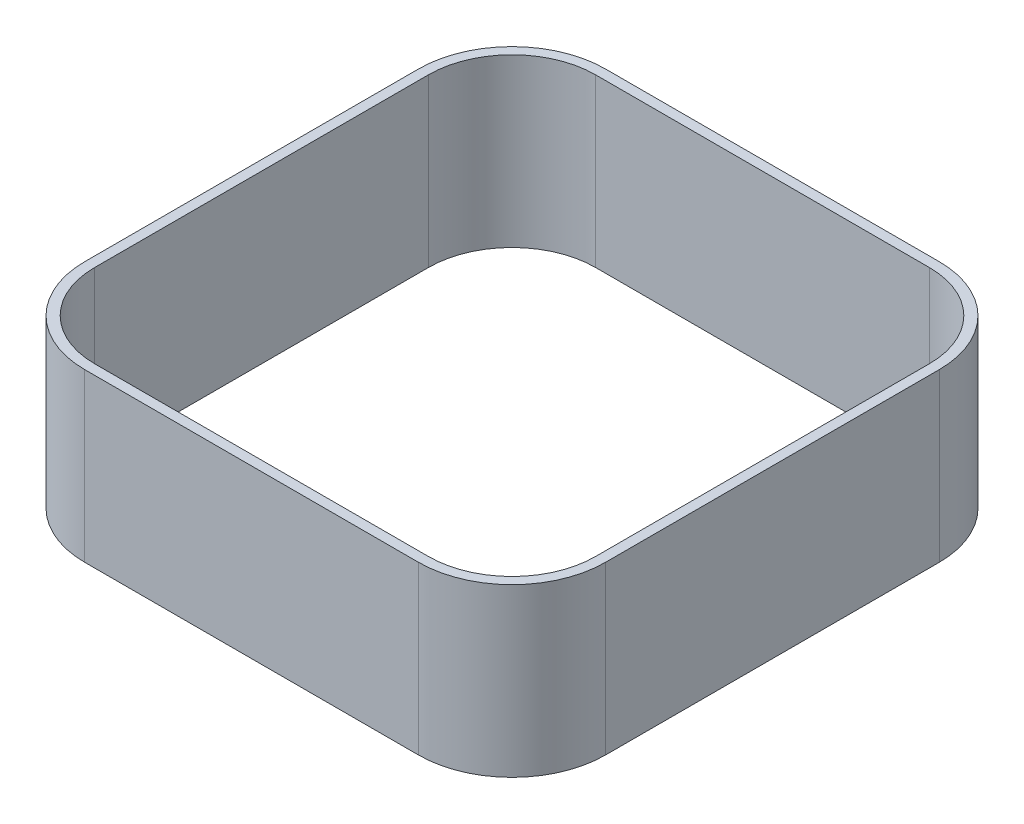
from build123d import *

# Parameters (mm, degrees)
SALIENTE_EXTRUIR1_DEPTH = 10


with BuildPart() as part:
    # Croquis1 → Saliente-Extruir1 (new body)
    with BuildSketch(Plane(origin=(0, 0, 0), x_dir=(1, 0, 0), z_dir=(0, 1, 0))):
        with BuildLine():
            Line((-15.6, -10), (-15.6, 10))
            ThreePointArc((-15.6, 10), (-13.959797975, 13.959797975), (-10, 15.6))
            Line((-10, 15.6), (10, 15.6))
            ThreePointArc((10, 15.6), (13.959797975, 13.959797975), (15.6, 10))
            Line((15.6, 10), (15.6, -10))
            ThreePointArc((15.6, -10), (13.959797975, -13.959797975), (10, -15.6))
            Line((10, -15.6), (-10, -15.6))
            ThreePointArc((-10, -15.6), (-13.959797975, -13.959797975), (-15.6, -10))
        make_face()
        with BuildLine():
            Line((-10, -15), (10, -15))
            ThreePointArc((10, -15), (13.535533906, -13.535533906), (15, -10))
            Line((15, -10), (15, 10))
            ThreePointArc((15, 10), (13.535533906, 13.535533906), (10, 15))
            Line((10, 15), (-10, 15))
            ThreePointArc((-10, 15), (-13.535533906, 13.535533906), (-15, 10))
            Line((-15, 10), (-15, -10))
            ThreePointArc((-15, -10), (-13.535533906, -13.535533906), (-10, -15))
        make_face(mode=Mode.SUBTRACT)
    extrude(amount=SALIENTE_EXTRUIR1_DEPTH)


solid = part.part
